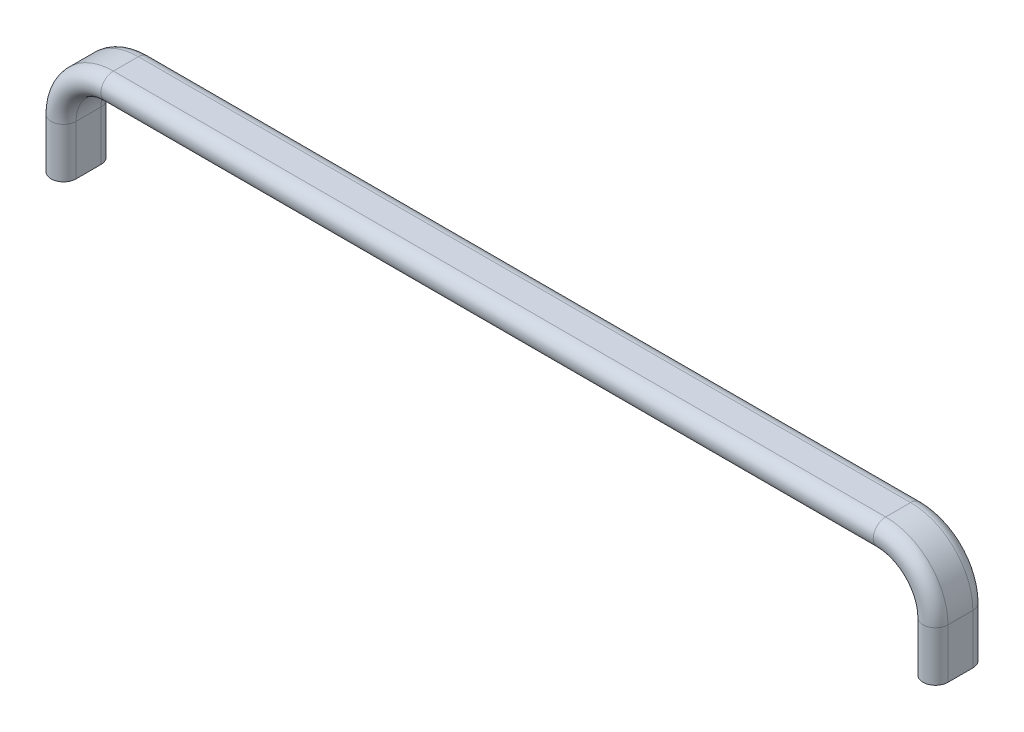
ISO-10303-21;
HEADER;
FILE_DESCRIPTION(('STEP AP214'),'2;1');
FILE_NAME('part.step','',(''),(''),'','','');
FILE_SCHEMA(('AUTOMOTIVE_DESIGN { 1 0 10303 214 1 1 1 1 }'));
ENDSEC;
DATA;
#1=APPLICATION_CONTEXT('core data for automotive mechanical design processes');
#2=APPLICATION_PROTOCOL_DEFINITION('international standard','automotive_design',2000,#1);
#3=PRODUCT_CONTEXT('',#1,'mechanical');
#4=PRODUCT('Part','Part','',(#3));
#5=PRODUCT_RELATED_PRODUCT_CATEGORY('part','',(#4));
#6=PRODUCT_DEFINITION_FORMATION('','',#4);
#7=PRODUCT_DEFINITION_CONTEXT('part definition',#1,'design');
#8=PRODUCT_DEFINITION('design','',#6,#7);
#9=PRODUCT_DEFINITION_SHAPE('','',#8);
#10=(LENGTH_UNIT() NAMED_UNIT(*) SI_UNIT(.MILLI.,.METRE.));
#11=(NAMED_UNIT(*) PLANE_ANGLE_UNIT() SI_UNIT($,.RADIAN.));
#12=(NAMED_UNIT(*) SI_UNIT($,.STERADIAN.) SOLID_ANGLE_UNIT());
#13=UNCERTAINTY_MEASURE_WITH_UNIT(LENGTH_MEASURE(1.E-05),#10,'distance_accuracy_value','');
#14=(GEOMETRIC_REPRESENTATION_CONTEXT(3) GLOBAL_UNCERTAINTY_ASSIGNED_CONTEXT((#13)) GLOBAL_UNIT_ASSIGNED_CONTEXT((#10,
#11,#12)) REPRESENTATION_CONTEXT('',''));
#15=CARTESIAN_POINT('',(0.,0.,0.));
#16=DIRECTION('',(0.,0.,1.));
#17=DIRECTION('',(1.,0.,0.));
#18=AXIS2_PLACEMENT_3D('',#15,#16,#17);
#19=CARTESIAN_POINT('',(175.,0.,-5.));
#20=DIRECTION('',(0.,1.,0.));
#21=DIRECTION('',(0.,0.,-1.));
#22=AXIS2_PLACEMENT_3D('',#19,#20,#21);
#23=PLANE('',#22);
#24=CARTESIAN_POINT('',(175.,0.,-5.));
#25=DIRECTION('',(0.,-1.,0.));
#26=DIRECTION('',(0.,0.,-1.));
#27=AXIS2_PLACEMENT_3D('',#24,#25,#26);
#28=CIRCLE('',#27,5.);
#29=CARTESIAN_POINT('',(170.,0.,-5.));
#30=VERTEX_POINT('',#29);
#31=CARTESIAN_POINT('',(180.,0.,-5.));
#32=VERTEX_POINT('',#31);
#33=EDGE_CURVE('E279',#30,#32,#28,.T.);
#34=ORIENTED_EDGE('',*,*,#33,.T.);
#35=DIRECTION('',(0.,0.,1.));
#36=VECTOR('',#35,1.);
#37=CARTESIAN_POINT('',(180.,0.,5.00000000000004));
#38=LINE('',#37,#36);
#39=CARTESIAN_POINT('',(180.,0.,5.00000000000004));
#40=VERTEX_POINT('',#39);
#41=EDGE_CURVE('E55',#32,#40,#38,.T.);
#42=ORIENTED_EDGE('',*,*,#41,.T.);
#43=CARTESIAN_POINT('',(175.,0.,5.00000000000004));
#44=DIRECTION('',(0.,-1.,0.));
#45=DIRECTION('',(0.,0.,1.));
#46=AXIS2_PLACEMENT_3D('',#43,#44,#45);
#47=CIRCLE('',#46,5.);
#48=CARTESIAN_POINT('',(170.,0.,5.00000000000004));
#49=VERTEX_POINT('',#48);
#50=EDGE_CURVE('E63',#40,#49,#47,.T.);
#51=ORIENTED_EDGE('',*,*,#50,.T.);
#52=DIRECTION('',(0.,0.,-1.));
#53=VECTOR('',#52,1.);
#54=CARTESIAN_POINT('',(170.,0.,-5.));
#55=LINE('',#54,#53);
#56=EDGE_CURVE('E282',#49,#30,#55,.T.);
#57=ORIENTED_EDGE('',*,*,#56,.T.);
#58=EDGE_LOOP('',(#34,#42,#51,#57));
#59=FACE_BOUND('',#58,.T.);
#60=CARTESIAN_POINT('',(175.,0.,0.));
#61=DIRECTION('',(0.,1.,0.));
#62=DIRECTION('',(0.,0.,-1.));
#63=AXIS2_PLACEMENT_3D('',#60,#61,#62);
#64=CIRCLE('',#63,2.5);
#65=CARTESIAN_POINT('',(175.,0.,-2.5));
#66=VERTEX_POINT('',#65);
#67=EDGE_CURVE('E445',#66,#66,#64,.T.);
#68=ORIENTED_EDGE('',*,*,#67,.T.);
#69=EDGE_LOOP('',(#68));
#70=FACE_BOUND('',#69,.T.);
#71=ADVANCED_FACE('F37',(#59,#70),#23,.F.);
#72=CARTESIAN_POINT('',(180.,20.,5.00000000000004));
#73=DIRECTION('',(1.,0.,0.));
#74=DIRECTION('',(0.,1.,0.));
#75=AXIS2_PLACEMENT_3D('',#72,#73,#74);
#76=PLANE('',#75);
#77=DIRECTION('',(0.,0.,1.));
#78=VECTOR('',#77,1.);
#79=CARTESIAN_POINT('',(180.,20.,5.00000000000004));
#80=LINE('',#79,#78);
#81=CARTESIAN_POINT('',(180.,20.,-5.));
#82=VERTEX_POINT('',#81);
#83=CARTESIAN_POINT('',(180.,20.,5.00000000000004));
#84=VERTEX_POINT('',#83);
#85=EDGE_CURVE('E247',#82,#84,#80,.T.);
#86=ORIENTED_EDGE('',*,*,#85,.T.);
#87=DIRECTION('',(0.,-1.,0.));
#88=VECTOR('',#87,1.);
#89=CARTESIAN_POINT('',(180.,20.,5.00000000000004));
#90=LINE('',#89,#88);
#91=EDGE_CURVE('E47',#84,#40,#90,.T.);
#92=ORIENTED_EDGE('',*,*,#91,.T.);
#93=ORIENTED_EDGE('',*,*,#41,.F.);
#94=DIRECTION('',(0.,-1.,0.));
#95=VECTOR('',#94,1.);
#96=CARTESIAN_POINT('',(180.,20.,-5.));
#97=LINE('',#96,#95);
#98=EDGE_CURVE('E11',#82,#32,#97,.T.);
#99=ORIENTED_EDGE('',*,*,#98,.F.);
#100=EDGE_LOOP('',(#86,#92,#93,#99));
#101=FACE_BOUND('',#100,.T.);
#102=ADVANCED_FACE('F39',(#101),#76,.T.);
#103=CARTESIAN_POINT('',(175.,20.,5.00000000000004));
#104=DIRECTION('',(0.,-1.,0.));
#105=DIRECTION('',(1.,0.,0.));
#106=AXIS2_PLACEMENT_3D('',#103,#104,#105);
#107=CYLINDRICAL_SURFACE('',#106,5.);
#108=CARTESIAN_POINT('',(175.,20.,5.00000000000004));
#109=DIRECTION('',(0.,-1.,0.));
#110=DIRECTION('',(0.,0.,1.));
#111=AXIS2_PLACEMENT_3D('',#108,#109,#110);
#112=CIRCLE('',#111,5.);
#113=CARTESIAN_POINT('',(170.,20.,5.00000000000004));
#114=VERTEX_POINT('',#113);
#115=EDGE_CURVE('E240',#84,#114,#112,.T.);
#116=ORIENTED_EDGE('',*,*,#115,.T.);
#117=DIRECTION('',(0.,-1.,0.));
#118=VECTOR('',#117,1.);
#119=CARTESIAN_POINT('',(170.,20.,5.00000000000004));
#120=LINE('',#119,#118);
#121=EDGE_CURVE('E242',#114,#49,#120,.T.);
#122=ORIENTED_EDGE('',*,*,#121,.T.);
#123=ORIENTED_EDGE('',*,*,#50,.F.);
#124=ORIENTED_EDGE('',*,*,#91,.F.);
#125=EDGE_LOOP('',(#116,#122,#123,#124));
#126=FACE_BOUND('',#125,.T.);
#127=ADVANCED_FACE('F153',(#126),#107,.T.);
#128=CARTESIAN_POINT('',(170.,20.,-5.));
#129=DIRECTION('',(-1.,0.,0.));
#130=DIRECTION('',(0.,-1.,0.));
#131=AXIS2_PLACEMENT_3D('',#128,#129,#130);
#132=PLANE('',#131);
#133=DIRECTION('',(0.,0.,-1.));
#134=VECTOR('',#133,1.);
#135=CARTESIAN_POINT('',(170.,20.,-5.));
#136=LINE('',#135,#134);
#137=CARTESIAN_POINT('',(170.,20.,-5.));
#138=VERTEX_POINT('',#137);
#139=EDGE_CURVE('E248',#114,#138,#136,.T.);
#140=ORIENTED_EDGE('',*,*,#139,.T.);
#141=DIRECTION('',(0.,-1.,0.));
#142=VECTOR('',#141,1.);
#143=CARTESIAN_POINT('',(170.,20.,-5.));
#144=LINE('',#143,#142);
#145=EDGE_CURVE('E290',#138,#30,#144,.T.);
#146=ORIENTED_EDGE('',*,*,#145,.T.);
#147=ORIENTED_EDGE('',*,*,#56,.F.);
#148=ORIENTED_EDGE('',*,*,#121,.F.);
#149=EDGE_LOOP('',(#140,#146,#147,#148));
#150=FACE_BOUND('',#149,.T.);
#151=ADVANCED_FACE('F231',(#150),#132,.T.);
#152=CARTESIAN_POINT('',(175.,20.,-5.));
#153=DIRECTION('',(0.,-1.,0.));
#154=DIRECTION('',(1.,0.,0.));
#155=AXIS2_PLACEMENT_3D('',#152,#153,#154);
#156=CYLINDRICAL_SURFACE('',#155,5.);
#157=CARTESIAN_POINT('',(175.,20.,-5.));
#158=DIRECTION('',(0.,-1.,0.));
#159=DIRECTION('',(0.,0.,-1.));
#160=AXIS2_PLACEMENT_3D('',#157,#158,#159);
#161=CIRCLE('',#160,5.);
#162=EDGE_CURVE('E259',#138,#82,#161,.T.);
#163=ORIENTED_EDGE('',*,*,#162,.T.);
#164=ORIENTED_EDGE('',*,*,#98,.T.);
#165=ORIENTED_EDGE('',*,*,#33,.F.);
#166=ORIENTED_EDGE('',*,*,#145,.F.);
#167=EDGE_LOOP('',(#163,#164,#165,#166));
#168=FACE_BOUND('',#167,.T.);
#169=ADVANCED_FACE('F227',(#168),#156,.T.);
#170=CARTESIAN_POINT('',(155.,20.,0.));
#171=DIRECTION('',(0.,0.,-1.));
#172=DIRECTION('',(-1.,0.,0.));
#173=AXIS2_PLACEMENT_3D('',#170,#171,#172);
#174=CYLINDRICAL_SURFACE('',#173,25.);
#175=DIRECTION('',(0.,0.,1.));
#176=VECTOR('',#175,1.);
#177=CARTESIAN_POINT('',(155.,45.,5.00000000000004));
#178=LINE('',#177,#176);
#179=CARTESIAN_POINT('',(155.,45.,-5.));
#180=VERTEX_POINT('',#179);
#181=CARTESIAN_POINT('',(155.,45.,5.00000000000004));
#182=VERTEX_POINT('',#181);
#183=EDGE_CURVE('E401',#180,#182,#178,.T.);
#184=ORIENTED_EDGE('',*,*,#183,.T.);
#185=CARTESIAN_POINT('',(155.,20.,5.00000000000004));
#186=DIRECTION('',(0.,0.,-1.));
#187=DIRECTION('',(-1.,0.,0.));
#188=AXIS2_PLACEMENT_3D('',#185,#186,#187);
#189=CIRCLE('',#188,25.);
#190=EDGE_CURVE('E265',#182,#84,#189,.T.);
#191=ORIENTED_EDGE('',*,*,#190,.T.);
#192=ORIENTED_EDGE('',*,*,#85,.F.);
#193=CARTESIAN_POINT('',(155.,20.,-5.));
#194=DIRECTION('',(0.,0.,-1.));
#195=DIRECTION('',(-1.,0.,0.));
#196=AXIS2_PLACEMENT_3D('',#193,#194,#195);
#197=CIRCLE('',#196,25.);
#198=EDGE_CURVE('E270',#180,#82,#197,.T.);
#199=ORIENTED_EDGE('',*,*,#198,.F.);
#200=EDGE_LOOP('',(#184,#191,#192,#199));
#201=FACE_BOUND('',#200,.T.);
#202=ADVANCED_FACE('F223',(#201),#174,.T.);
#203=CARTESIAN_POINT('',(155.,20.,5.00000000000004));
#204=DIRECTION('',(0.,0.,-1.));
#205=DIRECTION('',(-1.,0.,0.));
#206=AXIS2_PLACEMENT_3D('',#203,#204,#205);
#207=TOROIDAL_SURFACE('',#206,20.,5.);
#208=CARTESIAN_POINT('',(155.,40.,5.00000000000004));
#209=DIRECTION('',(1.,0.,0.));
#210=DIRECTION('',(0.,0.,1.));
#211=AXIS2_PLACEMENT_3D('',#208,#209,#210);
#212=CIRCLE('',#211,5.);
#213=CARTESIAN_POINT('',(155.,35.,5.00000000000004));
#214=VERTEX_POINT('',#213);
#215=EDGE_CURVE('E262',#182,#214,#212,.T.);
#216=ORIENTED_EDGE('',*,*,#215,.T.);
#217=CARTESIAN_POINT('',(155.,20.,5.00000000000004));
#218=DIRECTION('',(0.,0.,-1.));
#219=DIRECTION('',(-1.,0.,0.));
#220=AXIS2_PLACEMENT_3D('',#217,#218,#219);
#221=CIRCLE('',#220,15.);
#222=EDGE_CURVE('E253',#214,#114,#221,.T.);
#223=ORIENTED_EDGE('',*,*,#222,.T.);
#224=ORIENTED_EDGE('',*,*,#115,.F.);
#225=ORIENTED_EDGE('',*,*,#190,.F.);
#226=EDGE_LOOP('',(#216,#223,#224,#225));
#227=FACE_BOUND('',#226,.T.);
#228=ADVANCED_FACE('F219',(#227),#207,.T.);
#229=CARTESIAN_POINT('',(155.,20.,0.));
#230=DIRECTION('',(0.,0.,-1.));
#231=DIRECTION('',(-1.,0.,0.));
#232=AXIS2_PLACEMENT_3D('',#229,#230,#231);
#233=CYLINDRICAL_SURFACE('',#232,15.);
#234=DIRECTION('',(0.,0.,-1.));
#235=VECTOR('',#234,1.);
#236=CARTESIAN_POINT('',(155.,35.,-5.));
#237=LINE('',#236,#235);
#238=CARTESIAN_POINT('',(155.,35.,-5.));
#239=VERTEX_POINT('',#238);
#240=EDGE_CURVE('E396',#214,#239,#237,.T.);
#241=ORIENTED_EDGE('',*,*,#240,.T.);
#242=CARTESIAN_POINT('',(155.,20.,-5.));
#243=DIRECTION('',(0.,0.,-1.));
#244=DIRECTION('',(-1.,0.,0.));
#245=AXIS2_PLACEMENT_3D('',#242,#243,#244);
#246=CIRCLE('',#245,15.);
#247=EDGE_CURVE('E255',#239,#138,#246,.T.);
#248=ORIENTED_EDGE('',*,*,#247,.T.);
#249=ORIENTED_EDGE('',*,*,#139,.F.);
#250=ORIENTED_EDGE('',*,*,#222,.F.);
#251=EDGE_LOOP('',(#241,#248,#249,#250));
#252=FACE_BOUND('',#251,.T.);
#253=ADVANCED_FACE('F215',(#252),#233,.F.);
#254=CARTESIAN_POINT('',(155.,20.,-5.));
#255=DIRECTION('',(0.,0.,-1.));
#256=DIRECTION('',(-1.,0.,0.));
#257=AXIS2_PLACEMENT_3D('',#254,#255,#256);
#258=TOROIDAL_SURFACE('',#257,20.,5.);
#259=CARTESIAN_POINT('',(155.,40.,-5.));
#260=DIRECTION('',(1.,0.,0.));
#261=DIRECTION('',(0.,0.,-1.));
#262=AXIS2_PLACEMENT_3D('',#259,#260,#261);
#263=CIRCLE('',#262,5.);
#264=EDGE_CURVE('E393',#239,#180,#263,.T.);
#265=ORIENTED_EDGE('',*,*,#264,.T.);
#266=ORIENTED_EDGE('',*,*,#198,.T.);
#267=ORIENTED_EDGE('',*,*,#162,.F.);
#268=ORIENTED_EDGE('',*,*,#247,.F.);
#269=EDGE_LOOP('',(#265,#266,#267,#268));
#270=FACE_BOUND('',#269,.T.);
#271=ADVANCED_FACE('F211',(#270),#258,.T.);
#272=CARTESIAN_POINT('',(-155.,45.,5.00000000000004));
#273=DIRECTION('',(0.,1.,0.));
#274=DIRECTION('',(-1.,0.,0.));
#275=AXIS2_PLACEMENT_3D('',#272,#273,#274);
#276=PLANE('',#275);
#277=DIRECTION('',(0.,0.,1.));
#278=VECTOR('',#277,1.);
#279=CARTESIAN_POINT('',(-155.,45.,5.00000000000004));
#280=LINE('',#279,#278);
#281=CARTESIAN_POINT('',(-155.,45.,-5.));
#282=VERTEX_POINT('',#281);
#283=CARTESIAN_POINT('',(-155.,45.,5.00000000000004));
#284=VERTEX_POINT('',#283);
#285=EDGE_CURVE('E374',#282,#284,#280,.T.);
#286=ORIENTED_EDGE('',*,*,#285,.T.);
#287=DIRECTION('',(1.,0.,0.));
#288=VECTOR('',#287,1.);
#289=CARTESIAN_POINT('',(-155.,45.,5.00000000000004));
#290=LINE('',#289,#288);
#291=EDGE_CURVE('E412',#284,#182,#290,.T.);
#292=ORIENTED_EDGE('',*,*,#291,.T.);
#293=ORIENTED_EDGE('',*,*,#183,.F.);
#294=DIRECTION('',(1.,0.,0.));
#295=VECTOR('',#294,1.);
#296=CARTESIAN_POINT('',(-155.,45.,-5.));
#297=LINE('',#296,#295);
#298=EDGE_CURVE('E416',#282,#180,#297,.T.);
#299=ORIENTED_EDGE('',*,*,#298,.F.);
#300=EDGE_LOOP('',(#286,#292,#293,#299));
#301=FACE_BOUND('',#300,.T.);
#302=ADVANCED_FACE('F207',(#301),#276,.T.);
#303=CARTESIAN_POINT('',(-155.,40.,5.00000000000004));
#304=DIRECTION('',(1.,0.,0.));
#305=DIRECTION('',(0.,1.,0.));
#306=AXIS2_PLACEMENT_3D('',#303,#304,#305);
#307=CYLINDRICAL_SURFACE('',#306,5.);
#308=CARTESIAN_POINT('',(-155.,40.,5.00000000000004));
#309=DIRECTION('',(1.,0.,0.));
#310=DIRECTION('',(0.,0.,1.));
#311=AXIS2_PLACEMENT_3D('',#308,#309,#310);
#312=CIRCLE('',#311,5.);
#313=CARTESIAN_POINT('',(-155.,35.,5.00000000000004));
#314=VERTEX_POINT('',#313);
#315=EDGE_CURVE('E370',#284,#314,#312,.T.);
#316=ORIENTED_EDGE('',*,*,#315,.T.);
#317=DIRECTION('',(1.,0.,0.));
#318=VECTOR('',#317,1.);
#319=CARTESIAN_POINT('',(-155.,35.,5.00000000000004));
#320=LINE('',#319,#318);
#321=EDGE_CURVE('E409',#314,#214,#320,.T.);
#322=ORIENTED_EDGE('',*,*,#321,.T.);
#323=ORIENTED_EDGE('',*,*,#215,.F.);
#324=ORIENTED_EDGE('',*,*,#291,.F.);
#325=EDGE_LOOP('',(#316,#322,#323,#324));
#326=FACE_BOUND('',#325,.T.);
#327=ADVANCED_FACE('F203',(#326),#307,.T.);
#328=CARTESIAN_POINT('',(-155.,35.,-5.));
#329=DIRECTION('',(0.,-1.,0.));
#330=DIRECTION('',(1.,0.,0.));
#331=AXIS2_PLACEMENT_3D('',#328,#329,#330);
#332=PLANE('',#331);
#333=DIRECTION('',(0.,0.,-1.));
#334=VECTOR('',#333,1.);
#335=CARTESIAN_POINT('',(-155.,35.,-5.));
#336=LINE('',#335,#334);
#337=CARTESIAN_POINT('',(-155.,35.,-5.));
#338=VERTEX_POINT('',#337);
#339=EDGE_CURVE('E366',#314,#338,#336,.T.);
#340=ORIENTED_EDGE('',*,*,#339,.T.);
#341=DIRECTION('',(1.,0.,0.));
#342=VECTOR('',#341,1.);
#343=CARTESIAN_POINT('',(-155.,35.,-5.));
#344=LINE('',#343,#342);
#345=EDGE_CURVE('E405',#338,#239,#344,.T.);
#346=ORIENTED_EDGE('',*,*,#345,.T.);
#347=ORIENTED_EDGE('',*,*,#240,.F.);
#348=ORIENTED_EDGE('',*,*,#321,.F.);
#349=EDGE_LOOP('',(#340,#346,#347,#348));
#350=FACE_BOUND('',#349,.T.);
#351=ADVANCED_FACE('F199',(#350),#332,.T.);
#352=CARTESIAN_POINT('',(-155.,40.,-5.));
#353=DIRECTION('',(1.,0.,0.));
#354=DIRECTION('',(0.,1.,0.));
#355=AXIS2_PLACEMENT_3D('',#352,#353,#354);
#356=CYLINDRICAL_SURFACE('',#355,5.);
#357=CARTESIAN_POINT('',(-155.,40.,-5.));
#358=DIRECTION('',(1.,0.,0.));
#359=DIRECTION('',(0.,0.,-1.));
#360=AXIS2_PLACEMENT_3D('',#357,#358,#359);
#361=CIRCLE('',#360,5.);
#362=EDGE_CURVE('E362',#338,#282,#361,.T.);
#363=ORIENTED_EDGE('',*,*,#362,.T.);
#364=ORIENTED_EDGE('',*,*,#298,.T.);
#365=ORIENTED_EDGE('',*,*,#264,.F.);
#366=ORIENTED_EDGE('',*,*,#345,.F.);
#367=EDGE_LOOP('',(#363,#364,#365,#366));
#368=FACE_BOUND('',#367,.T.);
#369=ADVANCED_FACE('F195',(#368),#356,.T.);
#370=CARTESIAN_POINT('',(-155.,20.,0.));
#371=DIRECTION('',(0.,0.,-1.));
#372=DIRECTION('',(-1.,0.,0.));
#373=AXIS2_PLACEMENT_3D('',#370,#371,#372);
#374=CYLINDRICAL_SURFACE('',#373,25.);
#375=DIRECTION('',(0.,0.,1.));
#376=VECTOR('',#375,1.);
#377=CARTESIAN_POINT('',(-180.,20.,5.00000000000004));
#378=LINE('',#377,#376);
#379=CARTESIAN_POINT('',(-180.,20.,-5.));
#380=VERTEX_POINT('',#379);
#381=CARTESIAN_POINT('',(-180.,20.,5.00000000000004));
#382=VERTEX_POINT('',#381);
#383=EDGE_CURVE('E326',#380,#382,#378,.T.);
#384=ORIENTED_EDGE('',*,*,#383,.T.);
#385=CARTESIAN_POINT('',(-155.,20.,5.00000000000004));
#386=DIRECTION('',(0.,0.,-1.));
#387=DIRECTION('',(-1.,0.,0.));
#388=AXIS2_PLACEMENT_3D('',#385,#386,#387);
#389=CIRCLE('',#388,25.);
#390=EDGE_CURVE('E385',#382,#284,#389,.T.);
#391=ORIENTED_EDGE('',*,*,#390,.T.);
#392=ORIENTED_EDGE('',*,*,#285,.F.);
#393=CARTESIAN_POINT('',(-155.,20.,-5.));
#394=DIRECTION('',(0.,0.,-1.));
#395=DIRECTION('',(-1.,0.,0.));
#396=AXIS2_PLACEMENT_3D('',#393,#394,#395);
#397=CIRCLE('',#396,25.);
#398=EDGE_CURVE('E389',#380,#282,#397,.T.);
#399=ORIENTED_EDGE('',*,*,#398,.F.);
#400=EDGE_LOOP('',(#384,#391,#392,#399));
#401=FACE_BOUND('',#400,.T.);
#402=ADVANCED_FACE('F191',(#401),#374,.T.);
#403=CARTESIAN_POINT('',(-155.,20.,5.00000000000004));
#404=DIRECTION('',(0.,0.,-1.));
#405=DIRECTION('',(-1.,0.,0.));
#406=AXIS2_PLACEMENT_3D('',#403,#404,#405);
#407=TOROIDAL_SURFACE('',#406,20.,5.);
#408=CARTESIAN_POINT('',(-175.,20.,5.00000000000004));
#409=DIRECTION('',(0.,1.,0.));
#410=DIRECTION('',(0.,0.,1.));
#411=AXIS2_PLACEMENT_3D('',#408,#409,#410);
#412=CIRCLE('',#411,5.);
#413=CARTESIAN_POINT('',(-170.,20.,5.00000000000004));
#414=VERTEX_POINT('',#413);
#415=EDGE_CURVE('E331',#382,#414,#412,.T.);
#416=ORIENTED_EDGE('',*,*,#415,.T.);
#417=CARTESIAN_POINT('',(-155.,20.,5.00000000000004));
#418=DIRECTION('',(0.,0.,-1.));
#419=DIRECTION('',(-1.,0.,0.));
#420=AXIS2_PLACEMENT_3D('',#417,#418,#419);
#421=CIRCLE('',#420,15.);
#422=EDGE_CURVE('E381',#414,#314,#421,.T.);
#423=ORIENTED_EDGE('',*,*,#422,.T.);
#424=ORIENTED_EDGE('',*,*,#315,.F.);
#425=ORIENTED_EDGE('',*,*,#390,.F.);
#426=EDGE_LOOP('',(#416,#423,#424,#425));
#427=FACE_BOUND('',#426,.T.);
#428=ADVANCED_FACE('F187',(#427),#407,.T.);
#429=CARTESIAN_POINT('',(-155.,20.,0.));
#430=DIRECTION('',(0.,0.,-1.));
#431=DIRECTION('',(-1.,0.,0.));
#432=AXIS2_PLACEMENT_3D('',#429,#430,#431);
#433=CYLINDRICAL_SURFACE('',#432,15.);
#434=DIRECTION('',(0.,0.,-1.));
#435=VECTOR('',#434,1.);
#436=CARTESIAN_POINT('',(-170.,20.,-5.));
#437=LINE('',#436,#435);
#438=CARTESIAN_POINT('',(-170.,20.,-5.));
#439=VERTEX_POINT('',#438);
#440=EDGE_CURVE('E335',#414,#439,#437,.T.);
#441=ORIENTED_EDGE('',*,*,#440,.T.);
#442=CARTESIAN_POINT('',(-155.,20.,-5.));
#443=DIRECTION('',(0.,0.,-1.));
#444=DIRECTION('',(-1.,0.,0.));
#445=AXIS2_PLACEMENT_3D('',#442,#443,#444);
#446=CIRCLE('',#445,15.);
#447=EDGE_CURVE('E378',#439,#338,#446,.T.);
#448=ORIENTED_EDGE('',*,*,#447,.T.);
#449=ORIENTED_EDGE('',*,*,#339,.F.);
#450=ORIENTED_EDGE('',*,*,#422,.F.);
#451=EDGE_LOOP('',(#441,#448,#449,#450));
#452=FACE_BOUND('',#451,.T.);
#453=ADVANCED_FACE('F183',(#452),#433,.F.);
#454=CARTESIAN_POINT('',(-155.,20.,-5.));
#455=DIRECTION('',(0.,0.,-1.));
#456=DIRECTION('',(-1.,0.,0.));
#457=AXIS2_PLACEMENT_3D('',#454,#455,#456);
#458=TOROIDAL_SURFACE('',#457,20.,5.);
#459=CARTESIAN_POINT('',(-175.,20.,-5.));
#460=DIRECTION('',(0.,1.,0.));
#461=DIRECTION('',(0.,0.,-1.));
#462=AXIS2_PLACEMENT_3D('',#459,#460,#461);
#463=CIRCLE('',#462,5.);
#464=EDGE_CURVE('E323',#439,#380,#463,.T.);
#465=ORIENTED_EDGE('',*,*,#464,.T.);
#466=ORIENTED_EDGE('',*,*,#398,.T.);
#467=ORIENTED_EDGE('',*,*,#362,.F.);
#468=ORIENTED_EDGE('',*,*,#447,.F.);
#469=EDGE_LOOP('',(#465,#466,#467,#468));
#470=FACE_BOUND('',#469,.T.);
#471=ADVANCED_FACE('F179',(#470),#458,.T.);
#472=CARTESIAN_POINT('',(-175.,20.,-5.));
#473=DIRECTION('',(0.,-1.,0.));
#474=DIRECTION('',(1.,0.,0.));
#475=AXIS2_PLACEMENT_3D('',#472,#473,#474);
#476=CYLINDRICAL_SURFACE('',#475,5.);
#477=CARTESIAN_POINT('',(-175.,0.,-5.));
#478=DIRECTION('',(0.,1.,0.));
#479=DIRECTION('',(0.,0.,-1.));
#480=AXIS2_PLACEMENT_3D('',#477,#478,#479);
#481=CIRCLE('',#480,5.);
#482=CARTESIAN_POINT('',(-170.,0.,-5.));
#483=VERTEX_POINT('',#482);
#484=CARTESIAN_POINT('',(-180.,0.,-5.));
#485=VERTEX_POINT('',#484);
#486=EDGE_CURVE('E299',#483,#485,#481,.T.);
#487=ORIENTED_EDGE('',*,*,#486,.T.);
#488=DIRECTION('',(0.,-1.,0.));
#489=VECTOR('',#488,1.);
#490=CARTESIAN_POINT('',(-180.,20.,-5.));
#491=LINE('',#490,#489);
#492=EDGE_CURVE('E358',#380,#485,#491,.T.);
#493=ORIENTED_EDGE('',*,*,#492,.F.);
#494=ORIENTED_EDGE('',*,*,#464,.F.);
#495=DIRECTION('',(0.,-1.,0.));
#496=VECTOR('',#495,1.);
#497=CARTESIAN_POINT('',(-170.,20.,-5.));
#498=LINE('',#497,#496);
#499=EDGE_CURVE('E338',#439,#483,#498,.T.);
#500=ORIENTED_EDGE('',*,*,#499,.T.);
#501=EDGE_LOOP('',(#487,#493,#494,#500));
#502=FACE_BOUND('',#501,.T.);
#503=ADVANCED_FACE('F175',(#502),#476,.T.);
#504=CARTESIAN_POINT('',(-180.,20.,5.00000000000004));
#505=DIRECTION('',(1.,0.,0.));
#506=DIRECTION('',(0.,1.,0.));
#507=AXIS2_PLACEMENT_3D('',#504,#505,#506);
#508=PLANE('',#507);
#509=DIRECTION('',(0.,0.,1.));
#510=VECTOR('',#509,1.);
#511=CARTESIAN_POINT('',(-180.,0.,5.00000000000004));
#512=LINE('',#511,#510);
#513=CARTESIAN_POINT('',(-180.,0.,5.00000000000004));
#514=VERTEX_POINT('',#513);
#515=EDGE_CURVE('E306',#485,#514,#512,.T.);
#516=ORIENTED_EDGE('',*,*,#515,.T.);
#517=DIRECTION('',(0.,-1.,0.));
#518=VECTOR('',#517,1.);
#519=CARTESIAN_POINT('',(-180.,20.,5.00000000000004));
#520=LINE('',#519,#518);
#521=EDGE_CURVE('E354',#382,#514,#520,.T.);
#522=ORIENTED_EDGE('',*,*,#521,.F.);
#523=ORIENTED_EDGE('',*,*,#383,.F.);
#524=ORIENTED_EDGE('',*,*,#492,.T.);
#525=EDGE_LOOP('',(#516,#522,#523,#524));
#526=FACE_BOUND('',#525,.T.);
#527=ADVANCED_FACE('F171',(#526),#508,.F.);
#528=CARTESIAN_POINT('',(-175.,20.,5.00000000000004));
#529=DIRECTION('',(0.,-1.,0.));
#530=DIRECTION('',(1.,0.,0.));
#531=AXIS2_PLACEMENT_3D('',#528,#529,#530);
#532=CYLINDRICAL_SURFACE('',#531,5.);
#533=CARTESIAN_POINT('',(-175.,0.,5.00000000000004));
#534=DIRECTION('',(0.,1.,0.));
#535=DIRECTION('',(0.,0.,1.));
#536=AXIS2_PLACEMENT_3D('',#533,#534,#535);
#537=CIRCLE('',#536,5.);
#538=CARTESIAN_POINT('',(-170.,0.,5.00000000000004));
#539=VERTEX_POINT('',#538);
#540=EDGE_CURVE('E342',#514,#539,#537,.T.);
#541=ORIENTED_EDGE('',*,*,#540,.T.);
#542=DIRECTION('',(0.,-1.,0.));
#543=VECTOR('',#542,1.);
#544=CARTESIAN_POINT('',(-170.,20.,5.00000000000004));
#545=LINE('',#544,#543);
#546=EDGE_CURVE('E350',#414,#539,#545,.T.);
#547=ORIENTED_EDGE('',*,*,#546,.F.);
#548=ORIENTED_EDGE('',*,*,#415,.F.);
#549=ORIENTED_EDGE('',*,*,#521,.T.);
#550=EDGE_LOOP('',(#541,#547,#548,#549));
#551=FACE_BOUND('',#550,.T.);
#552=ADVANCED_FACE('F167',(#551),#532,.T.);
#553=CARTESIAN_POINT('',(-170.,20.,-5.));
#554=DIRECTION('',(-1.,0.,0.));
#555=DIRECTION('',(0.,-1.,0.));
#556=AXIS2_PLACEMENT_3D('',#553,#554,#555);
#557=PLANE('',#556);
#558=DIRECTION('',(0.,0.,-1.));
#559=VECTOR('',#558,1.);
#560=CARTESIAN_POINT('',(-170.,0.,-5.));
#561=LINE('',#560,#559);
#562=EDGE_CURVE('E327',#539,#483,#561,.T.);
#563=ORIENTED_EDGE('',*,*,#562,.T.);
#564=ORIENTED_EDGE('',*,*,#499,.F.);
#565=ORIENTED_EDGE('',*,*,#440,.F.);
#566=ORIENTED_EDGE('',*,*,#546,.T.);
#567=EDGE_LOOP('',(#563,#564,#565,#566));
#568=FACE_BOUND('',#567,.T.);
#569=ADVANCED_FACE('F163',(#568),#557,.F.);
#570=CARTESIAN_POINT('',(-175.,0.,-5.));
#571=DIRECTION('',(0.,-1.,0.));
#572=DIRECTION('',(0.,0.,-1.));
#573=AXIS2_PLACEMENT_3D('',#570,#571,#572);
#574=PLANE('',#573);
#575=CARTESIAN_POINT('',(-175.,0.,0.));
#576=DIRECTION('',(0.,-1.,0.));
#577=DIRECTION('',(0.,0.,-1.));
#578=AXIS2_PLACEMENT_3D('',#575,#576,#577);
#579=CIRCLE('',#578,2.5);
#580=CARTESIAN_POINT('',(-175.,0.,-2.5));
#581=VERTEX_POINT('',#580);
#582=EDGE_CURVE('E310',#581,#581,#579,.T.);
#583=ORIENTED_EDGE('',*,*,#582,.F.);
#584=EDGE_LOOP('',(#583));
#585=FACE_BOUND('',#584,.T.);
#586=ORIENTED_EDGE('',*,*,#486,.F.);
#587=ORIENTED_EDGE('',*,*,#562,.F.);
#588=ORIENTED_EDGE('',*,*,#540,.F.);
#589=ORIENTED_EDGE('',*,*,#515,.F.);
#590=EDGE_LOOP('',(#586,#587,#588,#589));
#591=FACE_BOUND('',#590,.T.);
#592=ADVANCED_FACE('F159',(#585,#591),#574,.T.);
#593=CARTESIAN_POINT('',(-175.,10.,0.));
#594=DIRECTION('',(0.,-1.,0.));
#595=DIRECTION('',(0.,0.,-1.));
#596=AXIS2_PLACEMENT_3D('',#593,#594,#595);
#597=PLANE('',#596);
#598=CARTESIAN_POINT('',(-175.,10.,0.));
#599=DIRECTION('',(0.,-1.,0.));
#600=DIRECTION('',(0.,0.,-1.));
#601=AXIS2_PLACEMENT_3D('',#598,#599,#600);
#602=CIRCLE('',#601,2.5);
#603=CARTESIAN_POINT('',(-175.,10.,-2.5));
#604=VERTEX_POINT('',#603);
#605=EDGE_CURVE('E300',#604,#604,#602,.T.);
#606=ORIENTED_EDGE('',*,*,#605,.T.);
#607=EDGE_LOOP('',(#606));
#608=FACE_BOUND('',#607,.T.);
#609=CARTESIAN_POINT('',(-175.,10.,0.));
#610=DIRECTION('',(0.,-1.,0.));
#611=DIRECTION('',(0.,0.,-1.));
#612=AXIS2_PLACEMENT_3D('',#609,#610,#611);
#613=CIRCLE('',#612,2.09999999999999);
#614=CARTESIAN_POINT('',(-175.,10.,-2.09999999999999));
#615=VERTEX_POINT('',#614);
#616=EDGE_CURVE('E296',#615,#615,#613,.F.);
#617=ORIENTED_EDGE('',*,*,#616,.T.);
#618=EDGE_LOOP('',(#617));
#619=FACE_BOUND('',#618,.T.);
#620=ADVANCED_FACE('F162',(#608,#619),#597,.T.);
#621=CARTESIAN_POINT('',(-175.,10.,0.));
#622=DIRECTION('',(0.,-1.,0.));
#623=DIRECTION('',(0.,0.,-1.));
#624=AXIS2_PLACEMENT_3D('',#621,#622,#623);
#625=CYLINDRICAL_SURFACE('',#624,2.5);
#626=ORIENTED_EDGE('',*,*,#605,.F.);
#627=EDGE_LOOP('',(#626));
#628=FACE_BOUND('',#627,.T.);
#629=ORIENTED_EDGE('',*,*,#582,.T.);
#630=EDGE_LOOP('',(#629));
#631=FACE_BOUND('',#630,.T.);
#632=ADVANCED_FACE('F474',(#628,#631),#625,.F.);
#633=CARTESIAN_POINT('',(-175.,12.5,0.));
#634=DIRECTION('',(0.,-1.,0.));
#635=DIRECTION('',(0.,0.,-1.));
#636=AXIS2_PLACEMENT_3D('',#633,#634,#635);
#637=CYLINDRICAL_SURFACE('',#636,2.09999999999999);
#638=CARTESIAN_POINT('',(-175.,12.5,0.));
#639=DIRECTION('',(0.,1.,0.));
#640=DIRECTION('',(0.,0.,1.));
#641=AXIS2_PLACEMENT_3D('',#638,#639,#640);
#642=CIRCLE('',#641,2.09999999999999);
#643=CARTESIAN_POINT('',(-175.,12.5,2.09999999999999));
#644=VERTEX_POINT('',#643);
#645=EDGE_CURVE('E318',#644,#644,#642,.T.);
#646=ORIENTED_EDGE('',*,*,#645,.T.);
#647=EDGE_LOOP('',(#646));
#648=FACE_BOUND('',#647,.T.);
#649=ORIENTED_EDGE('',*,*,#616,.F.);
#650=EDGE_LOOP('',(#649));
#651=FACE_BOUND('',#650,.T.);
#652=ADVANCED_FACE('F157',(#648,#651),#637,.F.);
#653=CARTESIAN_POINT('',(-175.,13.7124355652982,0.));
#654=DIRECTION('',(0.,-1.,0.));
#655=DIRECTION('',(0.,0.,-1.));
#656=AXIS2_PLACEMENT_3D('',#653,#654,#655);
#657=CONICAL_SURFACE('',#656,0.,1.0471975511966);
#658=ORIENTED_EDGE('',*,*,#645,.F.);
#659=EDGE_LOOP('',(#658));
#660=FACE_BOUND('',#659,.T.);
#661=CARTESIAN_POINT('',(-175.,13.7124355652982,0.));
#662=VERTEX_POINT('',#661);
#663=VERTEX_LOOP('',#662);
#664=FACE_BOUND('',#663,.T.);
#665=ADVANCED_FACE('F465',(#660,#664),#657,.F.);
#666=CARTESIAN_POINT('',(175.,10.,0.));
#667=DIRECTION('',(0.,-1.,0.));
#668=DIRECTION('',(0.,0.,-1.));
#669=AXIS2_PLACEMENT_3D('',#666,#667,#668);
#670=CYLINDRICAL_SURFACE('',#669,2.5);
#671=CARTESIAN_POINT('',(175.,10.,0.));
#672=DIRECTION('',(0.,1.,0.));
#673=DIRECTION('',(0.,0.,-1.));
#674=AXIS2_PLACEMENT_3D('',#671,#672,#673);
#675=CIRCLE('',#674,2.5);
#676=CARTESIAN_POINT('',(175.,10.,-2.5));
#677=VERTEX_POINT('',#676);
#678=EDGE_CURVE('E444',#677,#677,#675,.T.);
#679=ORIENTED_EDGE('',*,*,#678,.T.);
#680=EDGE_LOOP('',(#679));
#681=FACE_BOUND('',#680,.T.);
#682=ORIENTED_EDGE('',*,*,#67,.F.);
#683=EDGE_LOOP('',(#682));
#684=FACE_BOUND('',#683,.T.);
#685=ADVANCED_FACE('F460',(#681,#684),#670,.F.);
#686=CARTESIAN_POINT('',(175.,10.,0.));
#687=DIRECTION('',(0.,-1.,0.));
#688=DIRECTION('',(0.,0.,-1.));
#689=AXIS2_PLACEMENT_3D('',#686,#687,#688);
#690=PLANE('',#689);
#691=CARTESIAN_POINT('',(175.,10.,0.));
#692=DIRECTION('',(0.,-1.,0.));
#693=DIRECTION('',(0.,0.,-1.));
#694=AXIS2_PLACEMENT_3D('',#691,#692,#693);
#695=CIRCLE('',#694,2.09999999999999);
#696=CARTESIAN_POINT('',(175.,10.,-2.09999999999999));
#697=VERTEX_POINT('',#696);
#698=EDGE_CURVE('E41',#697,#697,#695,.T.);
#699=ORIENTED_EDGE('',*,*,#698,.F.);
#700=EDGE_LOOP('',(#699));
#701=FACE_BOUND('',#700,.T.);
#702=ORIENTED_EDGE('',*,*,#678,.F.);
#703=EDGE_LOOP('',(#702));
#704=FACE_BOUND('',#703,.T.);
#705=ADVANCED_FACE('F142',(#701,#704),#690,.T.);
#706=CARTESIAN_POINT('',(175.,12.5,0.));
#707=DIRECTION('',(0.,-1.,0.));
#708=DIRECTION('',(0.,0.,-1.));
#709=AXIS2_PLACEMENT_3D('',#706,#707,#708);
#710=CYLINDRICAL_SURFACE('',#709,2.09999999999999);
#711=CARTESIAN_POINT('',(175.,12.5,0.));
#712=DIRECTION('',(0.,-1.,0.));
#713=DIRECTION('',(0.,0.,1.));
#714=AXIS2_PLACEMENT_3D('',#711,#712,#713);
#715=CIRCLE('',#714,2.09999999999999);
#716=CARTESIAN_POINT('',(175.,12.5,2.09999999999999));
#717=VERTEX_POINT('',#716);
#718=EDGE_CURVE('E447',#717,#717,#715,.T.);
#719=ORIENTED_EDGE('',*,*,#718,.F.);
#720=EDGE_LOOP('',(#719));
#721=FACE_BOUND('',#720,.T.);
#722=ORIENTED_EDGE('',*,*,#698,.T.);
#723=EDGE_LOOP('',(#722));
#724=FACE_BOUND('',#723,.T.);
#725=ADVANCED_FACE('F136',(#721,#724),#710,.F.);
#726=CARTESIAN_POINT('',(175.,13.7124355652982,0.));
#727=DIRECTION('',(0.,-1.,0.));
#728=DIRECTION('',(0.,0.,-1.));
#729=AXIS2_PLACEMENT_3D('',#726,#727,#728);
#730=CONICAL_SURFACE('',#729,0.,1.0471975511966);
#731=ORIENTED_EDGE('',*,*,#718,.T.);
#732=EDGE_LOOP('',(#731));
#733=FACE_BOUND('',#732,.T.);
#734=CARTESIAN_POINT('',(175.,13.7124355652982,0.));
#735=VERTEX_POINT('',#734);
#736=VERTEX_LOOP('',#735);
#737=FACE_BOUND('',#736,.T.);
#738=ADVANCED_FACE('F134',(#733,#737),#730,.F.);
#739=CLOSED_SHELL('',(#71,#102,#127,#151,#169,#202,#228,#253,#271,#302,#327,#351,#369,#402,#428,
#453,#471,#503,#527,#552,#569,#592,#620,#632,#652,#665,#685,#705,#725,#738));
#740=MANIFOLD_SOLID_BREP('B2',#739);
#741=ADVANCED_BREP_SHAPE_REPRESENTATION('',(#18,#740),#14);
#742=SHAPE_DEFINITION_REPRESENTATION(#9,#741);
ENDSEC;
END-ISO-10303-21;
